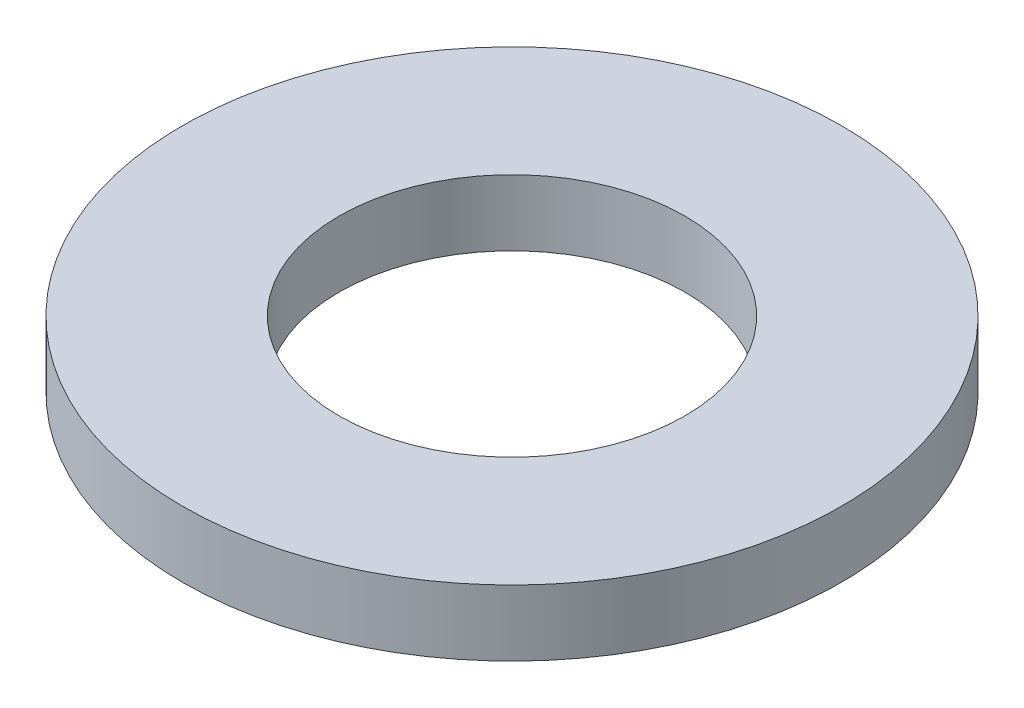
from build123d import *

# Parameters (mm, degrees)
SKETCH1_R      = 8
SKETCH1_R_2    = 4.2
EXTRUDE1_DEPTH = 1.6


with BuildPart() as part:
    # Sketch1 → Extrude1 (new body)
    with BuildSketch(Plane(origin=(0, 0, 0), x_dir=(1, 0, 0), z_dir=(0, 1, 0))):
        with Locations(Location((0, 0, 0), (0, 0, 270))):
            Circle(SKETCH1_R)
        with Locations(Location((0, 0, 0), (0, 0, 270))):
            Circle(SKETCH1_R_2, mode=Mode.SUBTRACT)
    extrude(amount=EXTRUDE1_DEPTH)


solid = part.part
